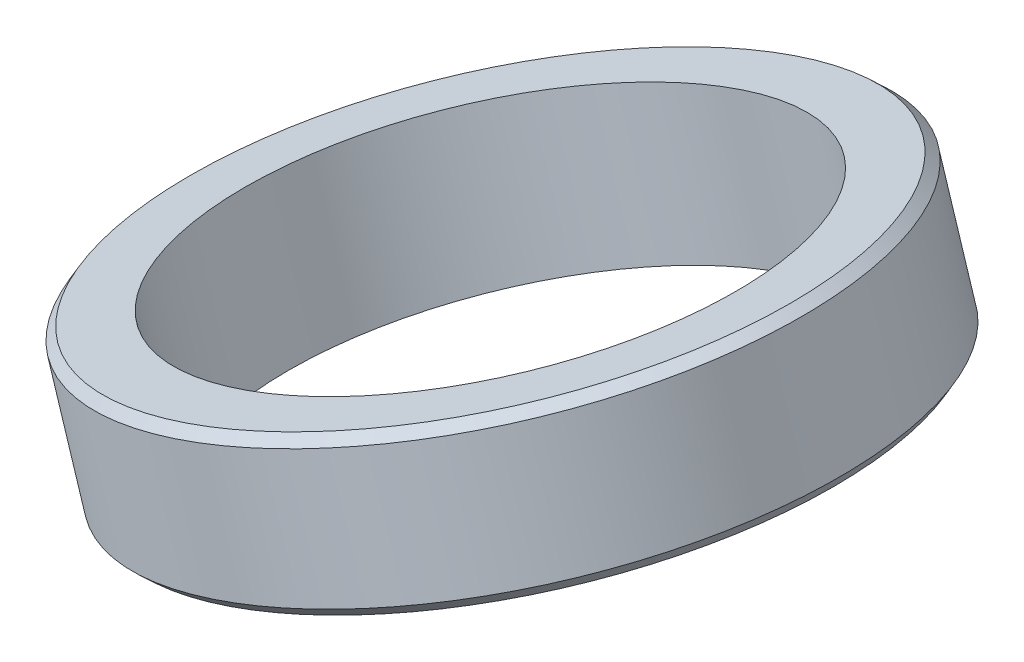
ISO-10303-21;
HEADER;
FILE_DESCRIPTION(('STEP AP214'),'2;1');
FILE_NAME('part.step','',(''),(''),'','','');
FILE_SCHEMA(('AUTOMOTIVE_DESIGN { 1 0 10303 214 1 1 1 1 }'));
ENDSEC;
DATA;
#1=APPLICATION_CONTEXT('core data for automotive mechanical design processes');
#2=APPLICATION_PROTOCOL_DEFINITION('international standard','automotive_design',2000,#1);
#3=PRODUCT_CONTEXT('',#1,'mechanical');
#4=PRODUCT('Part','Part','',(#3));
#5=PRODUCT_RELATED_PRODUCT_CATEGORY('part','',(#4));
#6=PRODUCT_DEFINITION_FORMATION('','',#4);
#7=PRODUCT_DEFINITION_CONTEXT('part definition',#1,'design');
#8=PRODUCT_DEFINITION('design','',#6,#7);
#9=PRODUCT_DEFINITION_SHAPE('','',#8);
#10=(LENGTH_UNIT() NAMED_UNIT(*) SI_UNIT(.MILLI.,.METRE.));
#11=(NAMED_UNIT(*) PLANE_ANGLE_UNIT() SI_UNIT($,.RADIAN.));
#12=(NAMED_UNIT(*) SI_UNIT($,.STERADIAN.) SOLID_ANGLE_UNIT());
#13=UNCERTAINTY_MEASURE_WITH_UNIT(LENGTH_MEASURE(1.E-05),#10,'distance_accuracy_value','');
#14=(GEOMETRIC_REPRESENTATION_CONTEXT(3) GLOBAL_UNCERTAINTY_ASSIGNED_CONTEXT((#13)) GLOBAL_UNIT_ASSIGNED_CONTEXT((#10,
#11,#12)) REPRESENTATION_CONTEXT('',''));
#15=CARTESIAN_POINT('',(0.,0.,0.));
#16=DIRECTION('',(0.,0.,1.));
#17=DIRECTION('',(1.,0.,0.));
#18=AXIS2_PLACEMENT_3D('',#15,#16,#17);
#19=CARTESIAN_POINT('',(355.271428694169,565.0485710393,0.));
#20=DIRECTION('',(-0.300714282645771,0.953714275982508,0.));
#21=DIRECTION('',(-0.953714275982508,-0.300714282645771,0.));
#22=AXIS2_PLACEMENT_3D('',#19,#20,#21);
#23=CYLINDRICAL_SURFACE('',#22,14.3);
#24=CARTESIAN_POINT('',(359.180714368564,552.650285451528,0.));
#25=DIRECTION('',(-0.300714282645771,0.953714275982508,0.));
#26=DIRECTION('',(-0.953714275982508,-0.300714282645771,0.));
#27=AXIS2_PLACEMENT_3D('',#24,#25,#26);
#28=CIRCLE('',#27,14.3);
#29=CARTESIAN_POINT('',(345.542600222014,548.350071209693,0.));
#30=VERTEX_POINT('',#29);
#31=EDGE_CURVE('E54',#30,#30,#28,.T.);
#32=ORIENTED_EDGE('',*,*,#31,.F.);
#33=EDGE_LOOP('',(#32));
#34=FACE_BOUND('',#33,.T.);
#35=CARTESIAN_POINT('',(356.775000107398,560.279999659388,0.));
#36=DIRECTION('',(-0.300714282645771,0.953714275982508,0.));
#37=DIRECTION('',(-0.953714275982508,-0.300714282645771,0.));
#38=AXIS2_PLACEMENT_3D('',#35,#36,#37);
#39=CIRCLE('',#38,14.3);
#40=CARTESIAN_POINT('',(343.136885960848,555.979785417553,0.));
#41=VERTEX_POINT('',#40);
#42=EDGE_CURVE('E10',#41,#41,#39,.T.);
#43=ORIENTED_EDGE('',*,*,#42,.T.);
#44=EDGE_LOOP('',(#43));
#45=FACE_BOUND('',#44,.T.);
#46=ADVANCED_FACE('F32',(#34,#45),#23,.F.);
#47=CARTESIAN_POINT('',(370.413114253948,564.580213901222,0.));
#48=DIRECTION('',(0.300714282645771,-0.953714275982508,0.));
#49=DIRECTION('',(0.953714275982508,0.300714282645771,0.));
#50=AXIS2_PLACEMENT_3D('',#47,#48,#49);
#51=PLANE('',#50);
#52=ORIENTED_EDGE('',*,*,#42,.F.);
#53=EDGE_LOOP('',(#52));
#54=FACE_BOUND('',#53,.T.);
#55=CARTESIAN_POINT('',(356.775000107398,560.279999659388,0.));
#56=DIRECTION('',(-0.300714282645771,0.953714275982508,0.));
#57=DIRECTION('',(-0.953714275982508,-0.300714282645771,0.));
#58=AXIS2_PLACEMENT_3D('',#55,#56,#57);
#59=CIRCLE('',#58,17.5);
#60=CARTESIAN_POINT('',(340.085000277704,555.017499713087,0.));
#61=VERTEX_POINT('',#60);
#62=EDGE_CURVE('E38',#61,#61,#59,.T.);
#63=ORIENTED_EDGE('',*,*,#62,.T.);
#64=EDGE_LOOP('',(#63));
#65=FACE_BOUND('',#64,.T.);
#66=ADVANCED_FACE('F61',(#54,#65),#51,.F.);
#67=CARTESIAN_POINT('',(356.925357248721,559.803142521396,0.));
#68=DIRECTION('',(0.300714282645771,-0.953714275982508,0.));
#69=DIRECTION('',(0.953714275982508,0.300714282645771,0.));
#70=AXIS2_PLACEMENT_3D('',#67,#68,#69);
#71=CONICAL_SURFACE('',#70,18.,0.785398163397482);
#72=ORIENTED_EDGE('',*,*,#62,.F.);
#73=EDGE_LOOP('',(#72));
#74=FACE_BOUND('',#73,.T.);
#75=CARTESIAN_POINT('',(356.925357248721,559.803142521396,0.));
#76=DIRECTION('',(-0.300714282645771,0.953714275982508,0.));
#77=DIRECTION('',(-0.953714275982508,-0.300714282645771,0.));
#78=AXIS2_PLACEMENT_3D('',#75,#76,#77);
#79=CIRCLE('',#78,18.);
#80=CARTESIAN_POINT('',(339.758500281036,554.390285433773,0.));
#81=VERTEX_POINT('',#80);
#82=EDGE_CURVE('E42',#81,#81,#79,.T.);
#83=ORIENTED_EDGE('',*,*,#82,.T.);
#84=EDGE_LOOP('',(#83));
#85=FACE_BOUND('',#84,.T.);
#86=ADVANCED_FACE('F65',(#74,#85),#71,.T.);
#87=CARTESIAN_POINT('',(355.271428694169,565.0485710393,0.));
#88=DIRECTION('',(-0.300714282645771,0.953714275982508,0.));
#89=DIRECTION('',(-0.953714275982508,-0.300714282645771,0.));
#90=AXIS2_PLACEMENT_3D('',#87,#88,#89);
#91=CYLINDRICAL_SURFACE('',#90,18.);
#92=ORIENTED_EDGE('',*,*,#82,.F.);
#93=EDGE_LOOP('',(#92));
#94=FACE_BOUND('',#93,.T.);
#95=CARTESIAN_POINT('',(359.030357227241,553.127142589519,0.));
#96=DIRECTION('',(-0.300714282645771,0.953714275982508,0.));
#97=DIRECTION('',(-0.953714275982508,-0.300714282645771,0.));
#98=AXIS2_PLACEMENT_3D('',#95,#96,#97);
#99=CIRCLE('',#98,18.);
#100=CARTESIAN_POINT('',(341.863500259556,547.714285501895,0.));
#101=VERTEX_POINT('',#100);
#102=EDGE_CURVE('E46',#101,#101,#99,.T.);
#103=ORIENTED_EDGE('',*,*,#102,.T.);
#104=EDGE_LOOP('',(#103));
#105=FACE_BOUND('',#104,.T.);
#106=ADVANCED_FACE('F70',(#94,#105),#91,.T.);
#107=CARTESIAN_POINT('',(359.180714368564,552.650285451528,0.));
#108=DIRECTION('',(-0.300714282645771,0.953714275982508,0.));
#109=DIRECTION('',(-0.953714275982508,-0.300714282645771,0.));
#110=AXIS2_PLACEMENT_3D('',#107,#108,#109);
#111=CONICAL_SURFACE('',#110,17.5,0.785398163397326);
#112=ORIENTED_EDGE('',*,*,#102,.F.);
#113=EDGE_LOOP('',(#112));
#114=FACE_BOUND('',#113,.T.);
#115=CARTESIAN_POINT('',(359.180714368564,552.650285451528,0.));
#116=DIRECTION('',(-0.300714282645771,0.953714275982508,0.));
#117=DIRECTION('',(-0.953714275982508,-0.300714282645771,0.));
#118=AXIS2_PLACEMENT_3D('',#115,#116,#117);
#119=CIRCLE('',#118,17.5);
#120=CARTESIAN_POINT('',(342.49071453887,547.387785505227,0.));
#121=VERTEX_POINT('',#120);
#122=EDGE_CURVE('E51',#121,#121,#119,.T.);
#123=ORIENTED_EDGE('',*,*,#122,.T.);
#124=EDGE_LOOP('',(#123));
#125=FACE_BOUND('',#124,.T.);
#126=ADVANCED_FACE('F76',(#114,#125),#111,.T.);
#127=CARTESIAN_POINT('',(375.870714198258,557.912785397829,0.));
#128=DIRECTION('',(-0.300714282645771,0.953714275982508,0.));
#129=DIRECTION('',(-0.953714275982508,-0.300714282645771,0.));
#130=AXIS2_PLACEMENT_3D('',#127,#128,#129);
#131=PLANE('',#130);
#132=ORIENTED_EDGE('',*,*,#122,.F.);
#133=EDGE_LOOP('',(#132));
#134=FACE_BOUND('',#133,.T.);
#135=ORIENTED_EDGE('',*,*,#31,.T.);
#136=EDGE_LOOP('',(#135));
#137=FACE_BOUND('',#136,.T.);
#138=ADVANCED_FACE('F58',(#134,#137),#131,.F.);
#139=CLOSED_SHELL('',(#46,#66,#86,#106,#126,#138));
#140=MANIFOLD_SOLID_BREP('B2',#139);
#141=ADVANCED_BREP_SHAPE_REPRESENTATION('',(#18,#140),#14);
#142=SHAPE_DEFINITION_REPRESENTATION(#9,#141);
ENDSEC;
END-ISO-10303-21;
